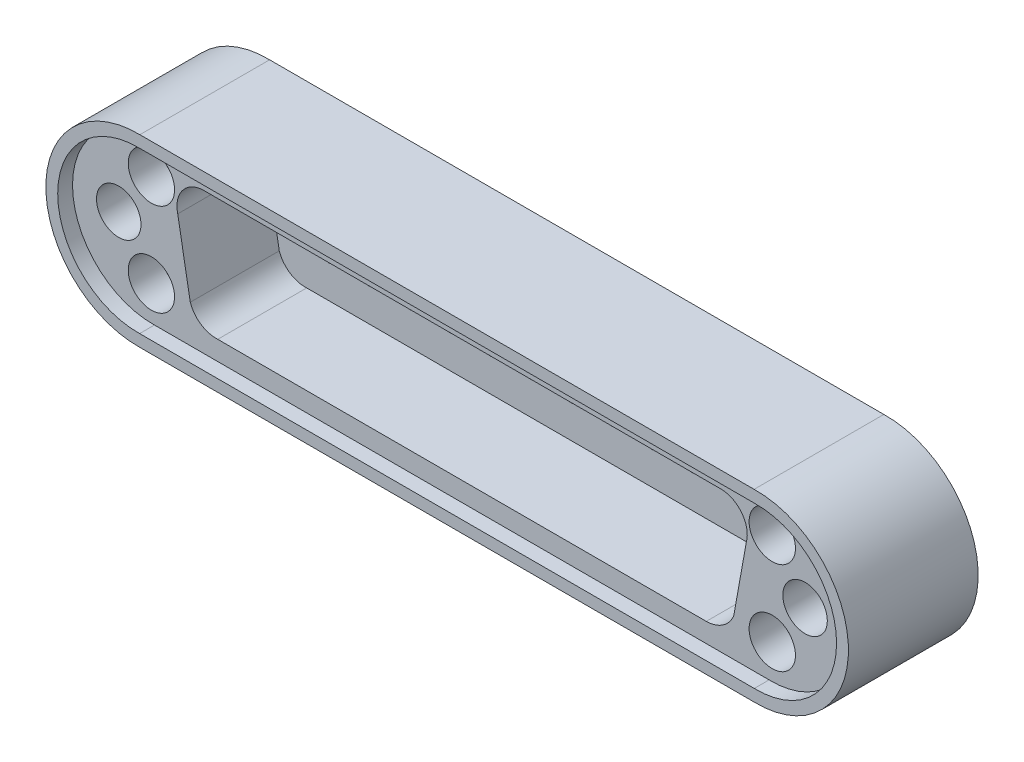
from build123d import *

# Parameters (mm, degrees)
SKETCH2_R       = 1.524
SKETCH2_R_2     = 0.889
EXTRUDE1_DEPTH  = 8.89
EXTRUDE6_DEPTH  = 1.016
EXTRUDE8_START  = 8.89
SKETCH2_3_R     = 1.524
EXTRUDE8_DEPTH  = 39.474350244
EXTRUDE9_DEPTH  = 5.334
SKETCH19_R      = 0.508
EXTRUDE10_DEPTH = 30.584350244
SKETCH20_R      = 1.5875
EXTRUDE11_DEPTH = 3.2512
EXTRUDE12_DEPTH = 1.016
EXTRUDE17_DEPTH = 6.096
EXTRUDE20_DEPTH = 1.524
EXTRUDE21_DEPTH = 1.524


with BuildPart() as part:
    # Sketch2 → Extrude1 (new body)
    with BuildSketch(Plane.XY):
        with BuildLine():
            ThreePointArc((21.032660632, 6.3119), (27.494977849, 0.000525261), (21.033686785, -6.3119))
            Line((21.033686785, -6.3119), (-21.058597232, -6.3119))
            ThreePointArc((-21.058597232, -6.3119), (-27.501627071, 0.00045005), (-21.057715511, 6.3119))
            Line((-21.057715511, 6.3119), (21.032660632, 6.3119))
        make_face()
        with Locations((-23.522686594, 0)):
            Circle(SKETCH2_R, mode=Mode.SUBTRACT)
        with Locations((-21.284946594, 3.2131)):
            Circle(SKETCH2_R_2, mode=Mode.SUBTRACT)
        with Locations((-21.284946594, -3.1369)):
            Circle(SKETCH2_R_2, mode=Mode.SUBTRACT)
        with Locations((23.507953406, 0)):
            Circle(SKETCH2_R, mode=Mode.SUBTRACT)
        with Locations((21.260053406, 3.2131)):
            Circle(SKETCH2_R_2, mode=Mode.SUBTRACT)
        with Locations((21.260053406, -3.1369)):
            Circle(SKETCH2_R_2, mode=Mode.SUBTRACT)
    extrude(amount=EXTRUDE1_DEPTH)

    # Sketch5 → Extrude6 (add)
    with BuildSketch(Plane.XY.offset(8.89)):
        with BuildLine():
            Line((-21.075306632, -5.499271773), (21.043519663, -5.4991))
            ThreePointArc((21.043519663, -5.4991), (26.682177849, 0.000491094), (21.042561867, 5.4991))
            Line((21.042561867, 5.4991), (-21.06641764, 5.4991))
            ThreePointArc((-21.06641764, 5.4991), (-26.68882529, 0.004454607), (-21.075306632, -5.499271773))
        make_face()
    extrude(amount=-EXTRUDE6_DEPTH)

    # Sketch2_3 → Extrude8 (cut, through all)
    with BuildSketch(Plane.XY.offset(EXTRUDE8_START)):
        with Locations((23.507953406, 0)):
            Circle(SKETCH2_3_R)
        with Locations((-23.522686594, 0)):
            Circle(SKETCH2_3_R)
    extrude(amount=-EXTRUDE8_DEPTH, mode=Mode.SUBTRACT)

    # Sketch17 → Extrude9 (add)
    with BuildSketch(Plane(origin=(0, 0, 7.874), x_dir=(-1, 0, 0), z_dir=(0, 0, -1))):
        with BuildLine():
            Line((-18.588829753, 1.942928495), (-17.757566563, -2.757071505))
            ThreePointArc((-17.757566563, -2.757071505), (-17.16680703, -3.742935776), (-16.067543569, -4.078413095))
            Line((-16.067543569, -4.078413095), (16.272456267, -4.078413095))
            ThreePointArc((16.272456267, -4.078413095), (17.230763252, -3.668980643), (17.733673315, -2.756254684))
            Line((17.733673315, -2.756254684), (18.562410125, 1.943745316))
            ThreePointArc((18.562410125, 1.943745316), (18.250606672, 3.207786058), (17.102447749, 3.821586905))
            Line((17.102447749, 3.821586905), (-16.897535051, 3.821586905))
            ThreePointArc((-16.897535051, 3.821586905), (-18.203152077, 3.29635335), (-18.588829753, 1.942928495))
        make_face()
    extrude(amount=EXTRUDE9_DEPTH)

    # Sketch19 → Extrude10 (cut, through all)
    with BuildSketch(Plane.XY.offset(8.89)):
        with Locations((0, 1.4224)):
            Circle(SKETCH19_R)
        with Locations((-1.3843, -1.4224)):
            Circle(SKETCH19_R)
        with Locations((2.7686, 1.4224)):
            Circle(SKETCH19_R)
        with Locations((5.5372, 1.4224)):
            Circle(SKETCH19_R)
        with Locations((8.3058, 1.4224)):
            Circle(SKETCH19_R)
        with Locations((11.0744, 1.4224)):
            Circle(SKETCH19_R)
        with Locations((13.843, 1.4224)):
            Circle(SKETCH19_R)
        with Locations((16.6116, 1.4224)):
            Circle(SKETCH19_R)
        with Locations((-2.54, 1.4224)):
            Circle(SKETCH19_R)
        with Locations((-5.08, 1.4224)):
            Circle(SKETCH19_R)
        with Locations((-7.62, 1.4224)):
            Circle(SKETCH19_R)
        with Locations((-10.16, 1.4224)):
            Circle(SKETCH19_R)
        with Locations((-12.7, 1.4224)):
            Circle(SKETCH19_R)
        with Locations((-15.24, 1.4224)):
            Circle(SKETCH19_R)
        with Locations((1.3843, -1.4224)):
            Circle(SKETCH19_R)
        with Locations((4.1529, -1.4224)):
            Circle(SKETCH19_R)
        with Locations((6.9215, -1.4224)):
            Circle(SKETCH19_R)
        with Locations((9.6901, -1.4224)):
            Circle(SKETCH19_R)
        with Locations((12.4587, -1.4224)):
            Circle(SKETCH19_R)
        with Locations((15.2273, -1.4224)):
            Circle(SKETCH19_R)
        with Locations((-4.1529, -1.4224)):
            Circle(SKETCH19_R)
        with Locations((-6.9215, -1.4224)):
            Circle(SKETCH19_R)
        with Locations((-9.6901, -1.4224)):
            Circle(SKETCH19_R)
        with Locations((-12.4587, -1.4224)):
            Circle(SKETCH19_R)
        with Locations((-15.2273, -1.4224)):
            Circle(SKETCH19_R)
    extrude(amount=-EXTRUDE10_DEPTH, mode=Mode.SUBTRACT)

    # Sketch20 → Extrude11 (cut)
    with BuildSketch(Plane.XY.offset(8.89)):
        with Locations((-21.284946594, 3.2131)):
            Circle(SKETCH20_R)
        with Locations((-21.284946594, -3.1369)):
            Circle(SKETCH20_R)
        with Locations((21.260053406, 3.2131)):
            Circle(SKETCH20_R)
        with Locations((21.260053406, -3.1369)):
            Circle(SKETCH20_R)
    extrude(amount=-EXTRUDE11_DEPTH, mode=Mode.SUBTRACT)

    # Sketch5_6 → Extrude12 (cut)
    with BuildSketch(Plane.XY.offset(8.89)):
        with BuildLine():
            Line((-21.075306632, -5.499271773), (21.043519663, -5.4991))
            ThreePointArc((21.043519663, -5.4991), (26.682177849, 0.000491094), (21.042561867, 5.4991))
            Line((21.042561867, 5.4991), (-21.06641764, 5.4991))
            ThreePointArc((-21.06641764, 5.4991), (-26.68882529, 0.004454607), (-21.075306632, -5.499271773))
        make_face()
    extrude(amount=-EXTRUDE12_DEPTH, mode=Mode.SUBTRACT)

    # Sketch25 → Extrude17 (cut)
    with BuildSketch(Plane.XY.offset(7.874)):
        with BuildLine():
            Line((-17.7546, 4.1783), (17.7546, 4.1783))
            ThreePointArc((17.7546, 4.1783), (19.183198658, 3.456599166), (19.4818, 1.884154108))
            Line((19.4818, 1.884154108), (18.6182, -2.918989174))
            ThreePointArc((18.6182, -2.918989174), (17.868100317, -3.831784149), (16.7386, -4.1783))
            Line((16.7386, -4.1783), (-16.7386, -4.1783))
            ThreePointArc((-16.7386, -4.1783), (-17.890119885, -3.864537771), (-18.6182, -2.918840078))
            Line((-18.6182, -2.918840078), (-19.4818, 1.893701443))
            ThreePointArc((-19.4818, 1.893701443), (-19.157991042, 3.444093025), (-17.7546, 4.1783))
        make_face()
    extrude(amount=-EXTRUDE17_DEPTH, mode=Mode.SUBTRACT)

    # Sketch30 → Extrude20 (cut)
    with BuildSketch(Plane(origin=(0, 0, 0), x_dir=(-1, 0, 0), z_dir=(0, 0, -1))):
        Polygon((-25.920953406, -1.3931462), (-23.507953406, -2.786292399), (-21.094953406, -1.3931462), (-21.094953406, 1.3931462), (-23.507953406, 2.786292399), (-25.920953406, 1.3931462), align=None)
    extrude(amount=-EXTRUDE20_DEPTH, mode=Mode.SUBTRACT)

    # Sketch31 → Extrude21 (cut)
    with BuildSketch(Plane(origin=(0, 0, 0), x_dir=(-1, 0, 0), z_dir=(0, 0, -1))):
        Polygon((21.109686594, -1.3931462), (23.522686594, -2.786292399), (25.935686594, -1.3931462), (25.935686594, 1.3931462), (23.522686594, 2.786292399), (21.109686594, 1.3931462), align=None)
    extrude(amount=-EXTRUDE21_DEPTH, mode=Mode.SUBTRACT)


solid = part.part
